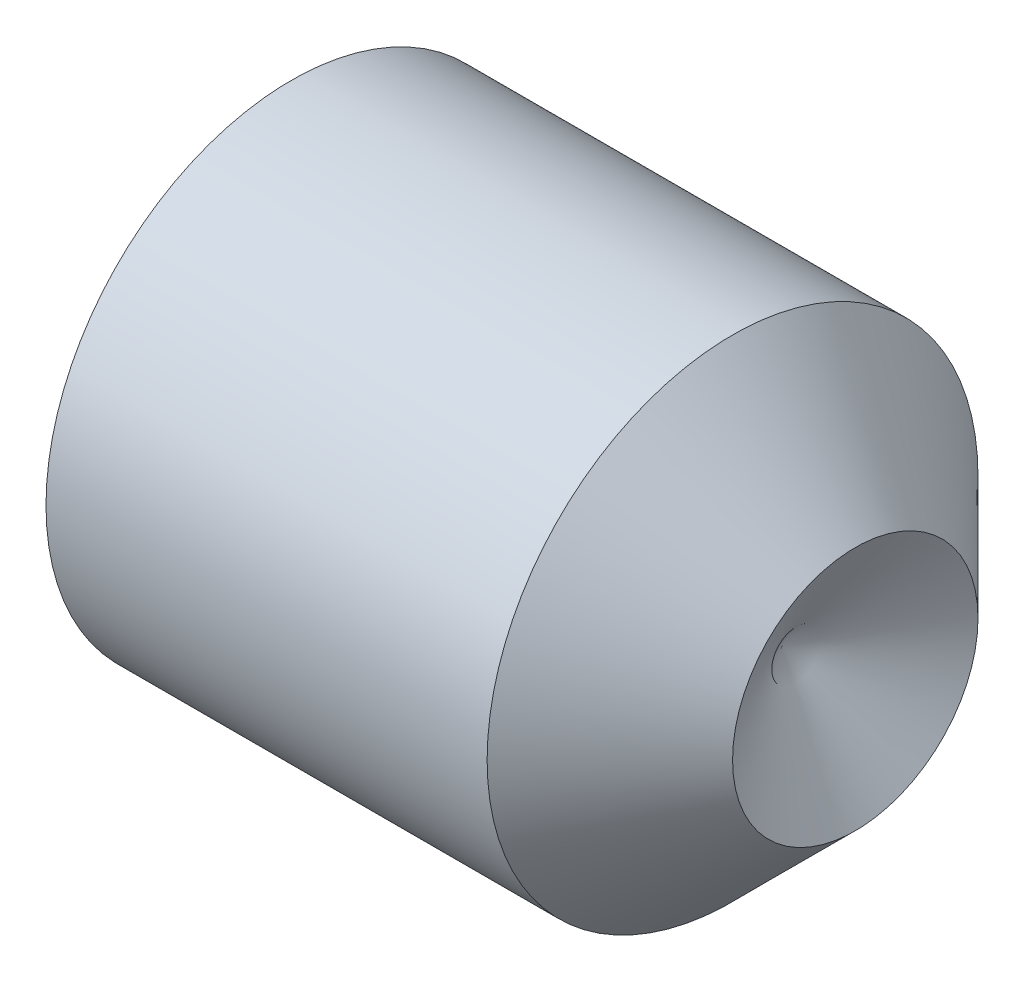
ISO-10303-21;
HEADER;
FILE_DESCRIPTION(('STEP AP214'),'2;1');
FILE_NAME('part.step','',(''),(''),'','','');
FILE_SCHEMA(('AUTOMOTIVE_DESIGN { 1 0 10303 214 1 1 1 1 }'));
ENDSEC;
DATA;
#1=APPLICATION_CONTEXT('core data for automotive mechanical design processes');
#2=APPLICATION_PROTOCOL_DEFINITION('international standard','automotive_design',2000,#1);
#3=PRODUCT_CONTEXT('',#1,'mechanical');
#4=PRODUCT('Part','Part','',(#3));
#5=PRODUCT_RELATED_PRODUCT_CATEGORY('part','',(#4));
#6=PRODUCT_DEFINITION_FORMATION('','',#4);
#7=PRODUCT_DEFINITION_CONTEXT('part definition',#1,'design');
#8=PRODUCT_DEFINITION('design','',#6,#7);
#9=PRODUCT_DEFINITION_SHAPE('','',#8);
#10=(LENGTH_UNIT() NAMED_UNIT(*) SI_UNIT(.MILLI.,.METRE.));
#11=(NAMED_UNIT(*) PLANE_ANGLE_UNIT() SI_UNIT($,.RADIAN.));
#12=(NAMED_UNIT(*) SI_UNIT($,.STERADIAN.) SOLID_ANGLE_UNIT());
#13=UNCERTAINTY_MEASURE_WITH_UNIT(LENGTH_MEASURE(1.E-05),#10,'distance_accuracy_value','');
#14=(GEOMETRIC_REPRESENTATION_CONTEXT(3) GLOBAL_UNCERTAINTY_ASSIGNED_CONTEXT((#13)) GLOBAL_UNIT_ASSIGNED_CONTEXT((#10,
#11,#12)) REPRESENTATION_CONTEXT('',''));
#15=CARTESIAN_POINT('',(0.,0.,0.));
#16=DIRECTION('',(0.,0.,1.));
#17=DIRECTION('',(1.,0.,0.));
#18=AXIS2_PLACEMENT_3D('',#15,#16,#17);
#19=CARTESIAN_POINT('',(0.,0.,0.));
#20=DIRECTION('',(-1.,0.,0.));
#21=DIRECTION('',(0.,0.,1.));
#22=AXIS2_PLACEMENT_3D('',#19,#20,#21);
#23=PLANE('',#22);
#24=CARTESIAN_POINT('',(0.,0.,0.));
#25=DIRECTION('',(-1.,0.,0.));
#26=DIRECTION('',(0.,0.,1.));
#27=AXIS2_PLACEMENT_3D('',#24,#25,#26);
#28=CIRCLE('',#27,2.055);
#29=CARTESIAN_POINT('',(0.,0.,2.055));
#30=VERTEX_POINT('',#29);
#31=EDGE_CURVE('E11',#30,#30,#28,.T.);
#32=ORIENTED_EDGE('',*,*,#31,.T.);
#33=EDGE_LOOP('',(#32));
#34=FACE_BOUND('',#33,.T.);
#35=DIRECTION('',(0.,0.,-1.));
#36=VECTOR('',#35,1.);
#37=CARTESIAN_POINT('',(0.,1.25,0.72168783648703));
#38=LINE('',#37,#36);
#39=CARTESIAN_POINT('',(0.,1.25,0.72168783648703));
#40=VERTEX_POINT('',#39);
#41=CARTESIAN_POINT('',(0.,1.25,-0.721687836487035));
#42=VERTEX_POINT('',#41);
#43=EDGE_CURVE('E103',#40,#42,#38,.T.);
#44=ORIENTED_EDGE('',*,*,#43,.F.);
#45=DIRECTION('',(0.,-0.866025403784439,0.5));
#46=VECTOR('',#45,1.);
#47=CARTESIAN_POINT('',(0.,1.25,0.72168783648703));
#48=LINE('',#47,#46);
#49=CARTESIAN_POINT('',(0.,0.,1.44337567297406));
#50=VERTEX_POINT('',#49);
#51=EDGE_CURVE('E45',#40,#50,#48,.T.);
#52=ORIENTED_EDGE('',*,*,#51,.T.);
#53=DIRECTION('',(0.,0.866025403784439,0.5));
#54=VECTOR('',#53,1.);
#55=CARTESIAN_POINT('',(0.,-1.25,0.72168783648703));
#56=LINE('',#55,#54);
#57=CARTESIAN_POINT('',(0.,-1.25,0.72168783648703));
#58=VERTEX_POINT('',#57);
#59=EDGE_CURVE('E93',#58,#50,#56,.T.);
#60=ORIENTED_EDGE('',*,*,#59,.F.);
#61=DIRECTION('',(0.,0.,-1.));
#62=VECTOR('',#61,1.);
#63=CARTESIAN_POINT('',(0.,-1.25,0.72168783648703));
#64=LINE('',#63,#62);
#65=CARTESIAN_POINT('',(0.,-1.25,-0.721687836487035));
#66=VERTEX_POINT('',#65);
#67=EDGE_CURVE('E98',#58,#66,#64,.T.);
#68=ORIENTED_EDGE('',*,*,#67,.T.);
#69=DIRECTION('',(0.,0.866025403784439,-0.5));
#70=VECTOR('',#69,1.);
#71=CARTESIAN_POINT('',(0.,-1.25,-0.721687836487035));
#72=LINE('',#71,#70);
#73=CARTESIAN_POINT('',(0.,0.,-1.44337567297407));
#74=VERTEX_POINT('',#73);
#75=EDGE_CURVE('E107',#66,#74,#72,.T.);
#76=ORIENTED_EDGE('',*,*,#75,.T.);
#77=DIRECTION('',(0.,-0.866025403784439,-0.5));
#78=VECTOR('',#77,1.);
#79=CARTESIAN_POINT('',(0.,1.25,-0.721687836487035));
#80=LINE('',#79,#78);
#81=EDGE_CURVE('E110',#42,#74,#80,.T.);
#82=ORIENTED_EDGE('',*,*,#81,.F.);
#83=EDGE_LOOP('',(#44,#52,#60,#68,#76,#82));
#84=FACE_BOUND('',#83,.T.);
#85=ADVANCED_FACE('F31',(#34,#84),#23,.T.);
#86=CARTESIAN_POINT('',(0.,0.,0.));
#87=DIRECTION('',(1.,0.,0.));
#88=DIRECTION('',(0.,0.,-1.));
#89=AXIS2_PLACEMENT_3D('',#86,#87,#88);
#90=CONICAL_SURFACE('',#89,2.055,1.0471975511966);
#91=CARTESIAN_POINT('',(0.256920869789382,0.,0.));
#92=DIRECTION('',(-1.,0.,0.));
#93=DIRECTION('',(0.,0.,1.));
#94=AXIS2_PLACEMENT_3D('',#91,#92,#93);
#95=CIRCLE('',#94,2.5);
#96=CARTESIAN_POINT('',(0.256920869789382,0.,2.5));
#97=VERTEX_POINT('',#96);
#98=EDGE_CURVE('E38',#97,#97,#95,.T.);
#99=ORIENTED_EDGE('',*,*,#98,.T.);
#100=EDGE_LOOP('',(#99));
#101=FACE_BOUND('',#100,.T.);
#102=ORIENTED_EDGE('',*,*,#31,.F.);
#103=EDGE_LOOP('',(#102));
#104=FACE_BOUND('',#103,.T.);
#105=ADVANCED_FACE('F143',(#101,#104),#90,.T.);
#106=CARTESIAN_POINT('',(-12.7,0.,0.));
#107=DIRECTION('',(-1.,0.,0.));
#108=DIRECTION('',(0.,0.,1.));
#109=AXIS2_PLACEMENT_3D('',#106,#107,#108);
#110=CYLINDRICAL_SURFACE('',#109,2.5);
#111=CARTESIAN_POINT('',(4.75000000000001,0.,0.));
#112=DIRECTION('',(-1.,0.,0.));
#113=DIRECTION('',(0.,0.,1.));
#114=AXIS2_PLACEMENT_3D('',#111,#112,#113);
#115=CIRCLE('',#114,2.5);
#116=CARTESIAN_POINT('',(4.75000000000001,0.,2.5));
#117=VERTEX_POINT('',#116);
#118=EDGE_CURVE('E138',#117,#117,#115,.T.);
#119=ORIENTED_EDGE('',*,*,#118,.T.);
#120=EDGE_LOOP('',(#119));
#121=FACE_BOUND('',#120,.T.);
#122=ORIENTED_EDGE('',*,*,#98,.F.);
#123=EDGE_LOOP('',(#122));
#124=FACE_BOUND('',#123,.T.);
#125=ADVANCED_FACE('F146',(#121,#124),#110,.T.);
#126=CARTESIAN_POINT('',(4.75000000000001,0.,0.));
#127=DIRECTION('',(-1.,0.,0.));
#128=DIRECTION('',(0.,0.,1.));
#129=AXIS2_PLACEMENT_3D('',#126,#127,#128);
#130=CONICAL_SURFACE('',#129,2.5,0.785398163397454);
#131=CARTESIAN_POINT('',(6.,0.,0.));
#132=DIRECTION('',(-1.,0.,0.));
#133=DIRECTION('',(0.,0.,1.));
#134=AXIS2_PLACEMENT_3D('',#131,#132,#133);
#135=CIRCLE('',#134,1.25);
#136=CARTESIAN_POINT('',(6.,0.,1.25));
#137=VERTEX_POINT('',#136);
#138=EDGE_CURVE('E89',#137,#137,#135,.T.);
#139=ORIENTED_EDGE('',*,*,#138,.T.);
#140=EDGE_LOOP('',(#139));
#141=FACE_BOUND('',#140,.T.);
#142=ORIENTED_EDGE('',*,*,#118,.F.);
#143=EDGE_LOOP('',(#142));
#144=FACE_BOUND('',#143,.T.);
#145=ADVANCED_FACE('F148',(#141,#144),#130,.T.);
#146=CARTESIAN_POINT('',(5.24892422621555,0.,0.));
#147=DIRECTION('',(1.,0.,0.));
#148=DIRECTION('',(0.,0.,-1.));
#149=AXIS2_PLACEMENT_3D('',#146,#147,#148);
#150=CONICAL_SURFACE('',#149,0.,1.02974425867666);
#151=ORIENTED_EDGE('',*,*,#138,.F.);
#152=EDGE_LOOP('',(#151));
#153=FACE_BOUND('',#152,.T.);
#154=CARTESIAN_POINT('',(5.24892422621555,0.,0.));
#155=VERTEX_POINT('',#154);
#156=VERTEX_LOOP('',#155);
#157=FACE_BOUND('',#156,.T.);
#158=ADVANCED_FACE('F155',(#153,#157),#150,.F.);
#159=CARTESIAN_POINT('',(2.7,1.25,0.72168783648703));
#160=DIRECTION('',(0.,-0.5,-0.866025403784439));
#161=DIRECTION('',(0.,0.866025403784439,-0.5));
#162=AXIS2_PLACEMENT_3D('',#159,#160,#161);
#163=PLANE('',#162);
#164=ORIENTED_EDGE('',*,*,#51,.F.);
#165=DIRECTION('',(-1.,0.,0.));
#166=VECTOR('',#165,1.);
#167=CARTESIAN_POINT('',(2.7,1.25,0.72168783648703));
#168=LINE('',#167,#166);
#169=CARTESIAN_POINT('',(2.7,1.25,0.72168783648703));
#170=VERTEX_POINT('',#169);
#171=EDGE_CURVE('E127',#170,#40,#168,.T.);
#172=ORIENTED_EDGE('',*,*,#171,.F.);
#173=DIRECTION('',(0.,-0.866025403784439,0.5));
#174=VECTOR('',#173,1.);
#175=CARTESIAN_POINT('',(2.7,1.25,0.72168783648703));
#176=LINE('',#175,#174);
#177=CARTESIAN_POINT('',(2.7,0.,1.44337567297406));
#178=VERTEX_POINT('',#177);
#179=EDGE_CURVE('E85',#170,#178,#176,.T.);
#180=ORIENTED_EDGE('',*,*,#179,.T.);
#181=DIRECTION('',(-1.,0.,0.));
#182=VECTOR('',#181,1.);
#183=CARTESIAN_POINT('',(2.7,0.,1.44337567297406));
#184=LINE('',#183,#182);
#185=EDGE_CURVE('E81',#178,#50,#184,.T.);
#186=ORIENTED_EDGE('',*,*,#185,.T.);
#187=EDGE_LOOP('',(#164,#172,#180,#186));
#188=FACE_BOUND('',#187,.T.);
#189=ADVANCED_FACE('F83',(#188),#163,.T.);
#190=CARTESIAN_POINT('',(2.7,-1.25,0.72168783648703));
#191=DIRECTION('',(0.,-0.5,0.866025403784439));
#192=DIRECTION('',(0.,-0.866025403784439,-0.5));
#193=AXIS2_PLACEMENT_3D('',#190,#191,#192);
#194=PLANE('',#193);
#195=ORIENTED_EDGE('',*,*,#59,.T.);
#196=ORIENTED_EDGE('',*,*,#185,.F.);
#197=DIRECTION('',(0.,0.866025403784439,0.5));
#198=VECTOR('',#197,1.);
#199=CARTESIAN_POINT('',(2.7,-1.25,0.72168783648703));
#200=LINE('',#199,#198);
#201=CARTESIAN_POINT('',(2.7,-1.25,0.72168783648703));
#202=VERTEX_POINT('',#201);
#203=EDGE_CURVE('E115',#202,#178,#200,.T.);
#204=ORIENTED_EDGE('',*,*,#203,.F.);
#205=DIRECTION('',(-1.,0.,0.));
#206=VECTOR('',#205,1.);
#207=CARTESIAN_POINT('',(2.7,-1.25,0.72168783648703));
#208=LINE('',#207,#206);
#209=EDGE_CURVE('E90',#202,#58,#208,.T.);
#210=ORIENTED_EDGE('',*,*,#209,.T.);
#211=EDGE_LOOP('',(#195,#196,#204,#210));
#212=FACE_BOUND('',#211,.T.);
#213=ADVANCED_FACE('F94',(#212),#194,.F.);
#214=CARTESIAN_POINT('',(2.7,-1.25,0.72168783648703));
#215=DIRECTION('',(0.,1.,0.));
#216=DIRECTION('',(0.,0.,1.));
#217=AXIS2_PLACEMENT_3D('',#214,#215,#216);
#218=PLANE('',#217);
#219=ORIENTED_EDGE('',*,*,#67,.F.);
#220=ORIENTED_EDGE('',*,*,#209,.F.);
#221=DIRECTION('',(0.,0.,-1.));
#222=VECTOR('',#221,1.);
#223=CARTESIAN_POINT('',(2.7,-1.25,0.72168783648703));
#224=LINE('',#223,#222);
#225=CARTESIAN_POINT('',(2.7,-1.25,-0.721687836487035));
#226=VERTEX_POINT('',#225);
#227=EDGE_CURVE('E117',#202,#226,#224,.T.);
#228=ORIENTED_EDGE('',*,*,#227,.T.);
#229=DIRECTION('',(-1.,0.,0.));
#230=VECTOR('',#229,1.);
#231=CARTESIAN_POINT('',(2.7,-1.25,-0.721687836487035));
#232=LINE('',#231,#230);
#233=EDGE_CURVE('E133',#226,#66,#232,.T.);
#234=ORIENTED_EDGE('',*,*,#233,.T.);
#235=EDGE_LOOP('',(#219,#220,#228,#234));
#236=FACE_BOUND('',#235,.T.);
#237=ADVANCED_FACE('F200',(#236),#218,.T.);
#238=CARTESIAN_POINT('',(2.7,-1.25,-0.721687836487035));
#239=DIRECTION('',(0.,0.5,0.866025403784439));
#240=DIRECTION('',(0.,-0.866025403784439,0.5));
#241=AXIS2_PLACEMENT_3D('',#238,#239,#240);
#242=PLANE('',#241);
#243=ORIENTED_EDGE('',*,*,#75,.F.);
#244=ORIENTED_EDGE('',*,*,#233,.F.);
#245=DIRECTION('',(0.,0.866025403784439,-0.5));
#246=VECTOR('',#245,1.);
#247=CARTESIAN_POINT('',(2.7,-1.25,-0.721687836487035));
#248=LINE('',#247,#246);
#249=CARTESIAN_POINT('',(2.7,0.,-1.44337567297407));
#250=VERTEX_POINT('',#249);
#251=EDGE_CURVE('E119',#226,#250,#248,.T.);
#252=ORIENTED_EDGE('',*,*,#251,.T.);
#253=DIRECTION('',(-1.,0.,0.));
#254=VECTOR('',#253,1.);
#255=CARTESIAN_POINT('',(2.7,0.,-1.44337567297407));
#256=LINE('',#255,#254);
#257=EDGE_CURVE('E131',#250,#74,#256,.T.);
#258=ORIENTED_EDGE('',*,*,#257,.T.);
#259=EDGE_LOOP('',(#243,#244,#252,#258));
#260=FACE_BOUND('',#259,.T.);
#261=ADVANCED_FACE('F207',(#260),#242,.T.);
#262=CARTESIAN_POINT('',(2.7,1.25,-0.721687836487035));
#263=DIRECTION('',(0.,0.5,-0.866025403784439));
#264=DIRECTION('',(0.,0.866025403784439,0.5));
#265=AXIS2_PLACEMENT_3D('',#262,#263,#264);
#266=PLANE('',#265);
#267=ORIENTED_EDGE('',*,*,#81,.T.);
#268=ORIENTED_EDGE('',*,*,#257,.F.);
#269=DIRECTION('',(0.,-0.866025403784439,-0.5));
#270=VECTOR('',#269,1.);
#271=CARTESIAN_POINT('',(2.7,1.25,-0.721687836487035));
#272=LINE('',#271,#270);
#273=CARTESIAN_POINT('',(2.7,1.25,-0.721687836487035));
#274=VERTEX_POINT('',#273);
#275=EDGE_CURVE('E121',#274,#250,#272,.T.);
#276=ORIENTED_EDGE('',*,*,#275,.F.);
#277=DIRECTION('',(-1.,0.,0.));
#278=VECTOR('',#277,1.);
#279=CARTESIAN_POINT('',(2.7,1.25,-0.721687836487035));
#280=LINE('',#279,#278);
#281=EDGE_CURVE('E129',#274,#42,#280,.T.);
#282=ORIENTED_EDGE('',*,*,#281,.T.);
#283=EDGE_LOOP('',(#267,#268,#276,#282));
#284=FACE_BOUND('',#283,.T.);
#285=ADVANCED_FACE('F215',(#284),#266,.F.);
#286=CARTESIAN_POINT('',(2.7,1.25,0.72168783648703));
#287=DIRECTION('',(0.,1.,0.));
#288=DIRECTION('',(0.,0.,1.));
#289=AXIS2_PLACEMENT_3D('',#286,#287,#288);
#290=PLANE('',#289);
#291=ORIENTED_EDGE('',*,*,#43,.T.);
#292=ORIENTED_EDGE('',*,*,#281,.F.);
#293=DIRECTION('',(0.,0.,-1.));
#294=VECTOR('',#293,1.);
#295=CARTESIAN_POINT('',(2.7,1.25,0.72168783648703));
#296=LINE('',#295,#294);
#297=EDGE_CURVE('E124',#170,#274,#296,.T.);
#298=ORIENTED_EDGE('',*,*,#297,.F.);
#299=ORIENTED_EDGE('',*,*,#171,.T.);
#300=EDGE_LOOP('',(#291,#292,#298,#299));
#301=FACE_BOUND('',#300,.T.);
#302=ADVANCED_FACE('F223',(#301),#290,.F.);
#303=CARTESIAN_POINT('',(2.7,1.25,0.72168783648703));
#304=DIRECTION('',(1.,0.,0.));
#305=DIRECTION('',(0.,0.,-1.));
#306=AXIS2_PLACEMENT_3D('',#303,#304,#305);
#307=PLANE('',#306);
#308=ORIENTED_EDGE('',*,*,#179,.F.);
#309=ORIENTED_EDGE('',*,*,#297,.T.);
#310=ORIENTED_EDGE('',*,*,#275,.T.);
#311=ORIENTED_EDGE('',*,*,#251,.F.);
#312=ORIENTED_EDGE('',*,*,#227,.F.);
#313=ORIENTED_EDGE('',*,*,#203,.T.);
#314=EDGE_LOOP('',(#308,#309,#310,#311,#312,#313));
#315=FACE_BOUND('',#314,.T.);
#316=ADVANCED_FACE('F231',(#315),#307,.F.);
#317=CLOSED_SHELL('',(#85,#105,#125,#145,#158,#189,#213,#237,#261,#285,#302,#316));
#318=MANIFOLD_SOLID_BREP('B2',#317);
#319=ADVANCED_BREP_SHAPE_REPRESENTATION('',(#18,#318),#14);
#320=SHAPE_DEFINITION_REPRESENTATION(#9,#319);
ENDSEC;
END-ISO-10303-21;
